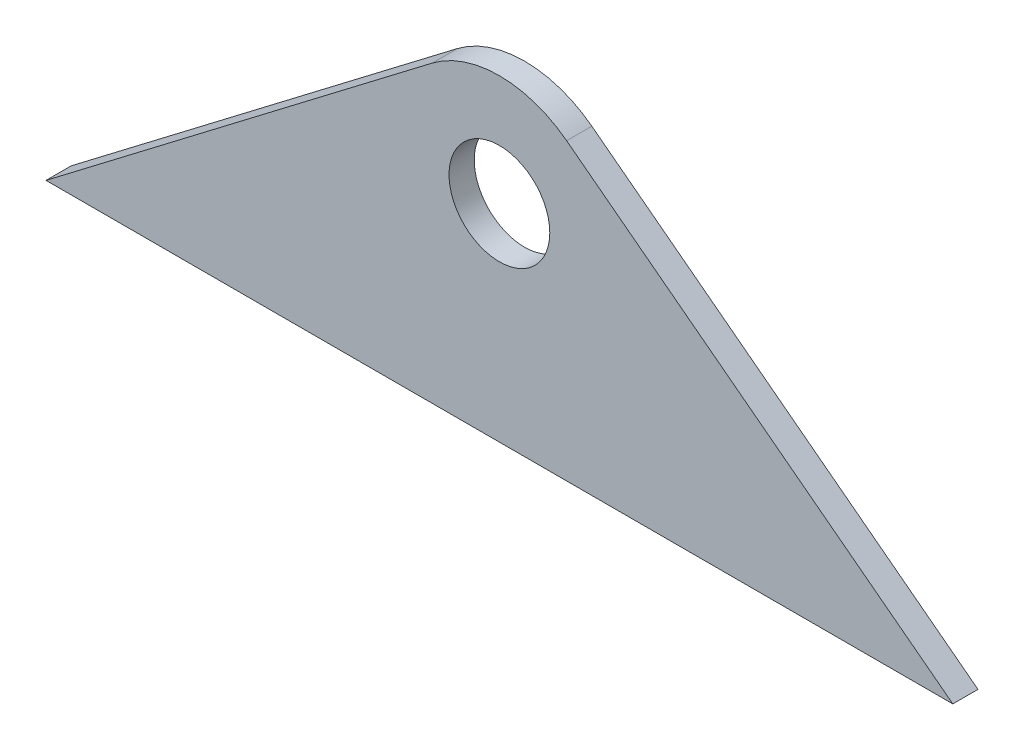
from build123d import *

# Parameters (mm, degrees)
ESQUISSE1_R      = 10
EXTRUSION1_DEPTH = 5


with BuildPart() as part:
    # Esquisse1 → Extrusion1 (new body)
    with BuildSketch(Plane.XY):
        with BuildLine():
            Line((-90, -41), (90, -41))
            Line((90, -41), (13.345434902, 17.489979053))
            ThreePointArc((13.345434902, 17.489979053), (0, 22), (-13.345434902, 17.489979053))
            Line((-13.345434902, 17.489979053), (-90, -41))
        make_face()
        Circle(ESQUISSE1_R, mode=Mode.SUBTRACT)
    extrude(amount=EXTRUSION1_DEPTH)


solid = part.part
